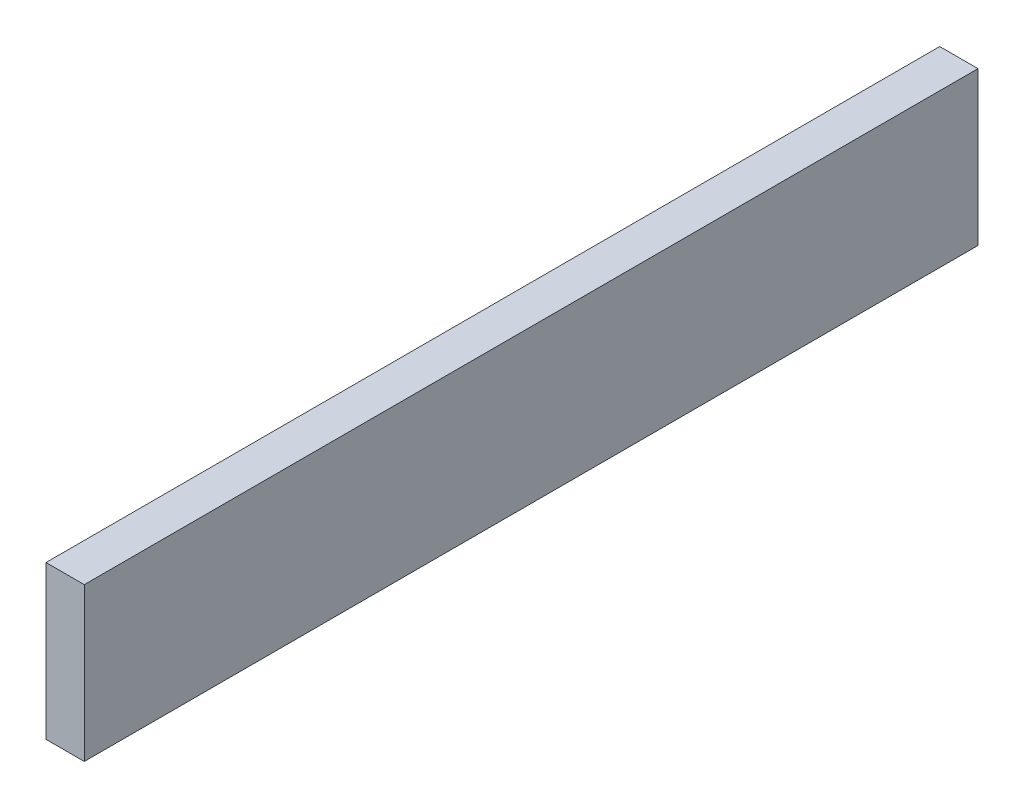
ISO-10303-21;
HEADER;
FILE_DESCRIPTION(('STEP AP214'),'2;1');
FILE_NAME('part.step','',(''),(''),'','','');
FILE_SCHEMA(('AUTOMOTIVE_DESIGN { 1 0 10303 214 1 1 1 1 }'));
ENDSEC;
DATA;
#1=APPLICATION_CONTEXT('core data for automotive mechanical design processes');
#2=APPLICATION_PROTOCOL_DEFINITION('international standard','automotive_design',2000,#1);
#3=PRODUCT_CONTEXT('',#1,'mechanical');
#4=PRODUCT('Part','Part','',(#3));
#5=PRODUCT_RELATED_PRODUCT_CATEGORY('part','',(#4));
#6=PRODUCT_DEFINITION_FORMATION('','',#4);
#7=PRODUCT_DEFINITION_CONTEXT('part definition',#1,'design');
#8=PRODUCT_DEFINITION('design','',#6,#7);
#9=PRODUCT_DEFINITION_SHAPE('','',#8);
#10=(LENGTH_UNIT() NAMED_UNIT(*) SI_UNIT(.MILLI.,.METRE.));
#11=(NAMED_UNIT(*) PLANE_ANGLE_UNIT() SI_UNIT($,.RADIAN.));
#12=(NAMED_UNIT(*) SI_UNIT($,.STERADIAN.) SOLID_ANGLE_UNIT());
#13=UNCERTAINTY_MEASURE_WITH_UNIT(LENGTH_MEASURE(1.E-05),#10,'distance_accuracy_value','');
#14=(GEOMETRIC_REPRESENTATION_CONTEXT(3) GLOBAL_UNCERTAINTY_ASSIGNED_CONTEXT((#13)) GLOBAL_UNIT_ASSIGNED_CONTEXT((#10,
#11,#12)) REPRESENTATION_CONTEXT('',''));
#15=CARTESIAN_POINT('',(0.,0.,0.));
#16=DIRECTION('',(0.,0.,1.));
#17=DIRECTION('',(1.,0.,0.));
#18=AXIS2_PLACEMENT_3D('',#15,#16,#17);
#19=CARTESIAN_POINT('',(12.7,-50.8,592.836));
#20=DIRECTION('',(-1.,0.,0.));
#21=DIRECTION('',(0.,0.,1.));
#22=AXIS2_PLACEMENT_3D('',#19,#20,#21);
#23=PLANE('',#22);
#24=DIRECTION('',(0.,1.,0.));
#25=VECTOR('',#24,1.);
#26=CARTESIAN_POINT('',(12.7,-50.8,0.));
#27=LINE('',#26,#25);
#28=CARTESIAN_POINT('',(12.7,-50.8,0.));
#29=VERTEX_POINT('',#28);
#30=CARTESIAN_POINT('',(12.7,50.8,0.));
#31=VERTEX_POINT('',#30);
#32=EDGE_CURVE('E96',#29,#31,#27,.T.);
#33=ORIENTED_EDGE('',*,*,#32,.T.);
#34=DIRECTION('',(0.,0.,-1.));
#35=VECTOR('',#34,1.);
#36=CARTESIAN_POINT('',(12.7,50.8,592.836));
#37=LINE('',#36,#35);
#38=CARTESIAN_POINT('',(12.7,50.8,592.836));
#39=VERTEX_POINT('',#38);
#40=EDGE_CURVE('E11',#39,#31,#37,.T.);
#41=ORIENTED_EDGE('',*,*,#40,.F.);
#42=DIRECTION('',(0.,1.,0.));
#43=VECTOR('',#42,1.);
#44=CARTESIAN_POINT('',(12.7,-50.8,592.836));
#45=LINE('',#44,#43);
#46=CARTESIAN_POINT('',(12.7,-50.8,592.836));
#47=VERTEX_POINT('',#46);
#48=EDGE_CURVE('E84',#47,#39,#45,.T.);
#49=ORIENTED_EDGE('',*,*,#48,.F.);
#50=DIRECTION('',(0.,0.,-1.));
#51=VECTOR('',#50,1.);
#52=CARTESIAN_POINT('',(12.7,-50.8,592.836));
#53=LINE('',#52,#51);
#54=EDGE_CURVE('E92',#47,#29,#53,.T.);
#55=ORIENTED_EDGE('',*,*,#54,.T.);
#56=EDGE_LOOP('',(#33,#41,#49,#55));
#57=FACE_BOUND('',#56,.T.);
#58=ADVANCED_FACE('F33',(#57),#23,.F.);
#59=CARTESIAN_POINT('',(-12.7,50.8,592.836));
#60=DIRECTION('',(0.,-1.,0.));
#61=DIRECTION('',(0.,0.,-1.));
#62=AXIS2_PLACEMENT_3D('',#59,#60,#61);
#63=PLANE('',#62);
#64=DIRECTION('',(-1.,0.,0.));
#65=VECTOR('',#64,1.);
#66=CARTESIAN_POINT('',(-12.7,50.8,0.));
#67=LINE('',#66,#65);
#68=CARTESIAN_POINT('',(-12.7,50.8,0.));
#69=VERTEX_POINT('',#68);
#70=EDGE_CURVE('E88',#31,#69,#67,.T.);
#71=ORIENTED_EDGE('',*,*,#70,.T.);
#72=DIRECTION('',(0.,0.,-1.));
#73=VECTOR('',#72,1.);
#74=CARTESIAN_POINT('',(-12.7,50.8,592.836));
#75=LINE('',#74,#73);
#76=CARTESIAN_POINT('',(-12.7,50.8,592.836));
#77=VERTEX_POINT('',#76);
#78=EDGE_CURVE('E41',#77,#69,#75,.T.);
#79=ORIENTED_EDGE('',*,*,#78,.F.);
#80=DIRECTION('',(-1.,0.,0.));
#81=VECTOR('',#80,1.);
#82=CARTESIAN_POINT('',(-12.7,50.8,592.836));
#83=LINE('',#82,#81);
#84=EDGE_CURVE('E79',#39,#77,#83,.T.);
#85=ORIENTED_EDGE('',*,*,#84,.F.);
#86=ORIENTED_EDGE('',*,*,#40,.T.);
#87=EDGE_LOOP('',(#71,#79,#85,#86));
#88=FACE_BOUND('',#87,.T.);
#89=ADVANCED_FACE('F87',(#88),#63,.F.);
#90=CARTESIAN_POINT('',(-12.7,-50.8,592.836));
#91=DIRECTION('',(1.,0.,0.));
#92=DIRECTION('',(0.,0.,-1.));
#93=AXIS2_PLACEMENT_3D('',#90,#91,#92);
#94=PLANE('',#93);
#95=DIRECTION('',(0.,-1.,0.));
#96=VECTOR('',#95,1.);
#97=CARTESIAN_POINT('',(-12.7,-50.8,0.));
#98=LINE('',#97,#96);
#99=CARTESIAN_POINT('',(-12.7,-50.8,0.));
#100=VERTEX_POINT('',#99);
#101=EDGE_CURVE('E66',#69,#100,#98,.T.);
#102=ORIENTED_EDGE('',*,*,#101,.T.);
#103=DIRECTION('',(0.,0.,-1.));
#104=VECTOR('',#103,1.);
#105=CARTESIAN_POINT('',(-12.7,-50.8,592.836));
#106=LINE('',#105,#104);
#107=CARTESIAN_POINT('',(-12.7,-50.8,592.836));
#108=VERTEX_POINT('',#107);
#109=EDGE_CURVE('E89',#108,#100,#106,.T.);
#110=ORIENTED_EDGE('',*,*,#109,.F.);
#111=DIRECTION('',(0.,-1.,0.));
#112=VECTOR('',#111,1.);
#113=CARTESIAN_POINT('',(-12.7,-50.8,592.836));
#114=LINE('',#113,#112);
#115=EDGE_CURVE('E82',#77,#108,#114,.T.);
#116=ORIENTED_EDGE('',*,*,#115,.F.);
#117=ORIENTED_EDGE('',*,*,#78,.T.);
#118=EDGE_LOOP('',(#102,#110,#116,#117));
#119=FACE_BOUND('',#118,.T.);
#120=ADVANCED_FACE('F90',(#119),#94,.F.);
#121=CARTESIAN_POINT('',(-12.7,-50.8,592.836));
#122=DIRECTION('',(0.,1.,0.));
#123=DIRECTION('',(0.,0.,1.));
#124=AXIS2_PLACEMENT_3D('',#121,#122,#123);
#125=PLANE('',#124);
#126=DIRECTION('',(1.,0.,0.));
#127=VECTOR('',#126,1.);
#128=CARTESIAN_POINT('',(-12.7,-50.8,0.));
#129=LINE('',#128,#127);
#130=EDGE_CURVE('E72',#100,#29,#129,.T.);
#131=ORIENTED_EDGE('',*,*,#130,.T.);
#132=ORIENTED_EDGE('',*,*,#54,.F.);
#133=DIRECTION('',(1.,0.,0.));
#134=VECTOR('',#133,1.);
#135=CARTESIAN_POINT('',(-12.7,-50.8,592.836));
#136=LINE('',#135,#134);
#137=EDGE_CURVE('E49',#108,#47,#136,.T.);
#138=ORIENTED_EDGE('',*,*,#137,.F.);
#139=ORIENTED_EDGE('',*,*,#109,.T.);
#140=EDGE_LOOP('',(#131,#132,#138,#139));
#141=FACE_BOUND('',#140,.T.);
#142=ADVANCED_FACE('F103',(#141),#125,.F.);
#143=CARTESIAN_POINT('',(0.,0.,592.836));
#144=DIRECTION('',(0.,0.,-1.));
#145=DIRECTION('',(-1.,0.,0.));
#146=AXIS2_PLACEMENT_3D('',#143,#144,#145);
#147=PLANE('',#146);
#148=ORIENTED_EDGE('',*,*,#48,.T.);
#149=ORIENTED_EDGE('',*,*,#84,.T.);
#150=ORIENTED_EDGE('',*,*,#115,.T.);
#151=ORIENTED_EDGE('',*,*,#137,.T.);
#152=EDGE_LOOP('',(#148,#149,#150,#151));
#153=FACE_BOUND('',#152,.T.);
#154=ADVANCED_FACE('F80',(#153),#147,.F.);
#155=CARTESIAN_POINT('',(0.,0.,0.));
#156=DIRECTION('',(0.,0.,-1.));
#157=DIRECTION('',(-1.,0.,0.));
#158=AXIS2_PLACEMENT_3D('',#155,#156,#157);
#159=PLANE('',#158);
#160=ORIENTED_EDGE('',*,*,#32,.F.);
#161=ORIENTED_EDGE('',*,*,#130,.F.);
#162=ORIENTED_EDGE('',*,*,#101,.F.);
#163=ORIENTED_EDGE('',*,*,#70,.F.);
#164=EDGE_LOOP('',(#160,#161,#162,#163));
#165=FACE_BOUND('',#164,.T.);
#166=ADVANCED_FACE('F106',(#165),#159,.T.);
#167=CLOSED_SHELL('',(#58,#89,#120,#142,#154,#166));
#168=MANIFOLD_SOLID_BREP('B2',#167);
#169=ADVANCED_BREP_SHAPE_REPRESENTATION('',(#18,#168),#14);
#170=SHAPE_DEFINITION_REPRESENTATION(#9,#169);
ENDSEC;
END-ISO-10303-21;
